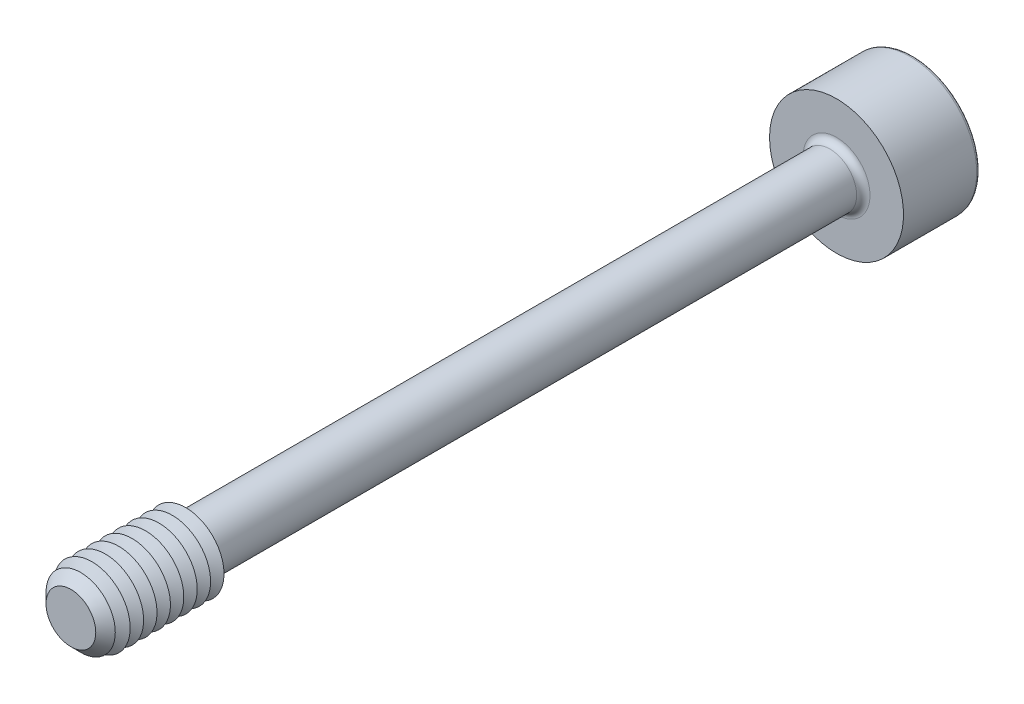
from build123d import *

# Parameters (mm, degrees)
SKETCH1_R       = 1.4
EXTRUDE1_DEPTH  = 20
CHAMFER1_SIZE   = 0.7
SKETCH3_R       = 3.5
EXTRUDE2_DEPTH  = 4
EXTRUDE3_DEPTH  = 3
FILLET1_R       = 0.35
FILLET2_R       = 0.175
LPATTERN1_COUNT = 8
LPATTERN1_PITCH = 0.7


with BuildPart() as part:
    # Sketch1 → Extrude1 (new, symmetric)
    with BuildSketch(Plane.XY):
        Circle(SKETCH1_R)
    extrude(amount=EXTRUDE1_DEPTH, both=True)

    # Sketch2 → Revolve1 (revolve)
    with BuildSketch(Plane(origin=(0, 0, 0), x_dir=(0, 0, -1), z_dir=(1, 0, 0))):
        Polygon((-20, 0), (-20, 2), (-14, 2), (-13.653589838, 1.4), (-13.653589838, 0), align=None)
    revolve(axis=Axis((0, 0, 13.653589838), (0, 0, 1)))

    # Chamfer1
    chamfer1_edges = [part.edges().sort_by_distance(p)[0] for p in [
        (0, -2, 20),
    ]]
    chamfer(chamfer1_edges, length=CHAMFER1_SIZE)

    # Sketch3 → Extrude2 (add)
    with BuildSketch(Plane(origin=(0, 0, -20), x_dir=(-1, 0, 0), z_dir=(0, 0, -1))):
        Circle(SKETCH3_R)
    extrude(amount=EXTRUDE2_DEPTH)

    # Sketch4 → Extrude3 (cut)
    with BuildSketch(Plane(origin=(-13.7, 0, -24), x_dir=(1, 0, 0), z_dir=(0, 0, 1))):
        Polygon((12.833974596, -1.5), (14.566025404, -1.5), (15.432050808, 0), (14.566025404, 1.5), (12.833974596, 1.5), (11.967949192, 0), align=None)
    extrude(amount=EXTRUDE3_DEPTH, mode=Mode.SUBTRACT)

    # Fillet1
    fillet1_edges = [part.edges().sort_by_distance(p)[0] for p in [
        (-1.4, 0, -20),
    ]]
    fillet(fillet1_edges, radius=FILLET1_R)

    # Fillet2
    fillet2_edges = [part.edges().sort_by_distance(p)[0] for p in [
        (3.5, 0, -24),
    ]]
    fillet(fillet2_edges, radius=FILLET2_R)

    # Sketch5 → Cut-Revolve1 (revolve, cut)
    with BuildSketch(Plane(origin=(0, 0, 0), x_dir=(0, 0, -1), z_dir=(1, 0, 0)), mode=Mode.PRIVATE) as cut_revolve1_sk:
        Polygon((21, 0), (21, -1.5), (20.133974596, 0), align=None)
    revolve(cut_revolve1_sk.sketch.rotate(Axis((0, 0, -20.133974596), (0, 0, -1)), 90), axis=Axis((0, 0, -20.133974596), (0, 0, -1)), mode=Mode.SUBTRACT)

    # Sketch7 → Cut-Revolve2 (revolve, cut)
    with BuildSketch(Plane(origin=(0, 0, 0), x_dir=(0, 0, -1), z_dir=(1, 0, 0)), mode=Mode.PRIVATE) as cut_revolve2_sk:
        Polygon((-14, 2), (-14.35, 1.393782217), (-14.7, 2), align=None)
    cut_revolve2 = revolve(cut_revolve2_sk.sketch.rotate(Axis((0, 0, -1.332048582), (0, 0, 1)), 90), axis=Axis((0, 0, -1.332048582), (0, 0, 1)), mode=Mode.SUBTRACT)

    # LPattern1: Cut-Revolve2 ×8
    with Locations(*[(0, 0, i * LPATTERN1_PITCH) for i in range(1, LPATTERN1_COUNT)]):
        add(cut_revolve2, mode=Mode.SUBTRACT)


solid = part.part
